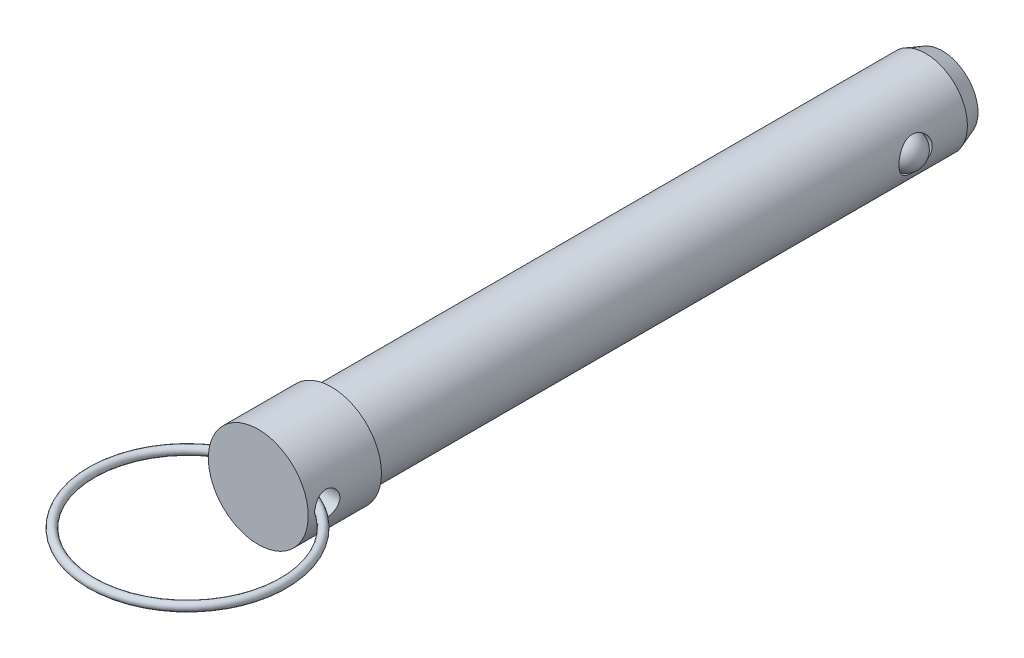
ISO-10303-21;
HEADER;
FILE_DESCRIPTION(('STEP AP214'),'2;1');
FILE_NAME('part.step','',(''),(''),'','','');
FILE_SCHEMA(('AUTOMOTIVE_DESIGN { 1 0 10303 214 1 1 1 1 }'));
ENDSEC;
DATA;
#1=APPLICATION_CONTEXT('core data for automotive mechanical design processes');
#2=APPLICATION_PROTOCOL_DEFINITION('international standard','automotive_design',2000,#1);
#3=PRODUCT_CONTEXT('',#1,'mechanical');
#4=PRODUCT('Part','Part','',(#3));
#5=PRODUCT_RELATED_PRODUCT_CATEGORY('part','',(#4));
#6=PRODUCT_DEFINITION_FORMATION('','',#4);
#7=PRODUCT_DEFINITION_CONTEXT('part definition',#1,'design');
#8=PRODUCT_DEFINITION('design','',#6,#7);
#9=PRODUCT_DEFINITION_SHAPE('','',#8);
#10=(LENGTH_UNIT() NAMED_UNIT(*) SI_UNIT(.MILLI.,.METRE.));
#11=(NAMED_UNIT(*) PLANE_ANGLE_UNIT() SI_UNIT($,.RADIAN.));
#12=(NAMED_UNIT(*) SI_UNIT($,.STERADIAN.) SOLID_ANGLE_UNIT());
#13=UNCERTAINTY_MEASURE_WITH_UNIT(LENGTH_MEASURE(1.E-05),#10,'distance_accuracy_value','');
#14=(GEOMETRIC_REPRESENTATION_CONTEXT(3) GLOBAL_UNCERTAINTY_ASSIGNED_CONTEXT((#13)) GLOBAL_UNIT_ASSIGNED_CONTEXT((#10,
#11,#12)) REPRESENTATION_CONTEXT('',''));
#15=CARTESIAN_POINT('',(0.,0.,0.));
#16=DIRECTION('',(0.,0.,1.));
#17=DIRECTION('',(1.,0.,0.));
#18=AXIS2_PLACEMENT_3D('',#15,#16,#17);
#19=CARTESIAN_POINT('',(12.7,0.,10.3124));
#20=DIRECTION('',(-1.,0.,0.));
#21=DIRECTION('',(0.,0.,-1.));
#22=AXIS2_PLACEMENT_3D('',#19,#20,#21);
#23=CYLINDRICAL_SURFACE('',#22,2.38125);
#24=CARTESIAN_POINT('',(-9.52520000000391,0.403786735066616,12.6591653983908));
#25=CARTESIAN_POINT('',(-9.50280720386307,0.376324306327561,12.6639011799));
#26=CARTESIAN_POINT('',(-9.48237104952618,0.347125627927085,12.6684187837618));
#27=CARTESIAN_POINT('',(-9.44617017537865,0.285700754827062,12.6766499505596));
#28=CARTESIAN_POINT('',(-9.43042598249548,0.253462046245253,12.680359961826));
#29=CARTESIAN_POINT('',(-9.40451586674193,0.186496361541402,12.6865748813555));
#30=CARTESIAN_POINT('',(-9.39437574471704,0.151758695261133,12.6890742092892));
#31=CARTESIAN_POINT('',(-9.38043438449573,0.0810334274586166,12.6925329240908));
#32=CARTESIAN_POINT('',(-9.37661767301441,0.0450490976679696,12.693496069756));
#33=CARTESIAN_POINT('',(-9.37556693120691,-0.0245285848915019,12.6937603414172));
#34=CARTESIAN_POINT('',(-9.37789685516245,-0.0581155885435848,12.6931715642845));
#35=CARTESIAN_POINT('',(-9.38809271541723,-0.124408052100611,12.690629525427));
#36=CARTESIAN_POINT('',(-9.39596338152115,-0.157112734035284,12.6886750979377));
#37=CARTESIAN_POINT('',(-9.416669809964,-0.220319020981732,12.6836454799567));
#38=CARTESIAN_POINT('',(-9.42943899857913,-0.250843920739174,12.6805853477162));
#39=CARTESIAN_POINT('',(-9.45932823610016,-0.309529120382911,12.6736319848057));
#40=CARTESIAN_POINT('',(-9.47644453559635,-0.337691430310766,12.6697394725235));
#41=CARTESIAN_POINT('',(-9.50487916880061,-0.377944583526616,12.6635052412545));
#42=CARTESIAN_POINT('',(-9.51483286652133,-0.391047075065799,12.6613580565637));
#43=CARTESIAN_POINT('',(-9.5252,-0.403786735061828,12.6591653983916));
#44=B_SPLINE_CURVE_WITH_KNOTS('',3,(#24,#25,#26,#27,#28,#29,#30,#31,#32,#33,#34,#35,#36,#37,#38,
#39,#40,#41,#42,#43),.UNSPECIFIED.,.F.,.F.,(4,2,2,2,2,2,2,2,2,4),(0.,0.107278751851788,
0.215020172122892,0.323253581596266,0.431221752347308,0.531739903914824,0.632343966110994,
0.731626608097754,0.830823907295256,0.880558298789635),.UNSPECIFIED.);
#45=CARTESIAN_POINT('',(-9.5168741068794,0.393360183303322,12.6609355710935));
#46=VERTEX_POINT('',#45);
#47=CARTESIAN_POINT('',(-9.5168741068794,-0.393360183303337,12.6609355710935));
#48=VERTEX_POINT('',#47);
#49=EDGE_CURVE('E40',#46,#48,#44,.T.);
#50=ORIENTED_EDGE('',*,*,#49,.F.);
#51=CARTESIAN_POINT('',(-9.525,0.,12.69365));
#52=CARTESIAN_POINT('',(-9.52499609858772,-0.131413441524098,12.6936432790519));
#53=CARTESIAN_POINT('',(-9.52225017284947,-0.262981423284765,12.6827233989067));
#54=CARTESIAN_POINT('',(-9.51155070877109,-0.522463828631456,12.6393611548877));
#55=CARTESIAN_POINT('',(-9.50358736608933,-0.650370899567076,12.6068782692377));
#56=CARTESIAN_POINT('',(-9.48333647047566,-0.898571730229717,12.5214962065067));
#57=CARTESIAN_POINT('',(-9.47105633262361,-1.01887813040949,12.4686320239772));
#58=CARTESIAN_POINT('',(-9.44348288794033,-1.24887539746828,12.3440911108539));
#59=CARTESIAN_POINT('',(-9.42819036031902,-1.35856899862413,12.2724192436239));
#60=CARTESIAN_POINT('',(-9.39589563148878,-1.56654481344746,12.1107209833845));
#61=CARTESIAN_POINT('',(-9.37886690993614,-1.66457667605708,12.0203778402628));
#62=CARTESIAN_POINT('',(-9.34519463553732,-1.84427203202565,11.8245754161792));
#63=CARTESIAN_POINT('',(-9.32855114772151,-1.92593277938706,11.7191136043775));
#64=CARTESIAN_POINT('',(-9.29726950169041,-2.07172989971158,11.4941421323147));
#65=CARTESIAN_POINT('',(-9.28266474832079,-2.135588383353,11.3744473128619));
#66=CARTESIAN_POINT('',(-9.25749814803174,-2.24218043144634,11.1255983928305));
#67=CARTESIAN_POINT('',(-9.24693562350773,-2.28491753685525,10.9964458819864));
#68=CARTESIAN_POINT('',(-9.23132007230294,-2.34720578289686,10.735082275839));
#69=CARTESIAN_POINT('',(-9.2261609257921,-2.36720420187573,10.6029842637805));
#70=CARTESIAN_POINT('',(-9.22161862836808,-2.38484057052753,10.337215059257));
#71=CARTESIAN_POINT('',(-9.22223454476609,-2.38248213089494,10.203544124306));
#72=CARTESIAN_POINT('',(-9.22907737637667,-2.35582865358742,9.94185283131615));
#73=CARTESIAN_POINT('',(-9.23516790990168,-2.33206678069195,9.81377404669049));
#74=CARTESIAN_POINT('',(-9.2520564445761,-2.26413118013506,9.56348014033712));
#75=CARTESIAN_POINT('',(-9.26285481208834,-2.21995586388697,9.44126547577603));
#76=CARTESIAN_POINT('',(-9.2880678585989,-2.11199151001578,9.2047369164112));
#77=CARTESIAN_POINT('',(-9.30251804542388,-2.0480084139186,9.09051554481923));
#78=CARTESIAN_POINT('',(-9.33338526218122,-1.90238497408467,8.87424717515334));
#79=CARTESIAN_POINT('',(-9.34980250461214,-1.82074272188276,8.77220149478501));
#80=CARTESIAN_POINT('',(-9.38332621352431,-1.63937203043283,8.58013373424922));
#81=CARTESIAN_POINT('',(-9.40043902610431,-1.53919654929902,8.49053442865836));
#82=CARTESIAN_POINT('',(-9.43301349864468,-1.32499024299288,8.32928984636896));
#83=CARTESIAN_POINT('',(-9.44847444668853,-1.21095348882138,8.25765229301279));
#84=CARTESIAN_POINT('',(-9.47608221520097,-0.971626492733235,8.1342112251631));
#85=CARTESIAN_POINT('',(-9.48821487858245,-0.846291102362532,8.08249206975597));
#86=CARTESIAN_POINT('',(-9.50767711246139,-0.588486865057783,8.00107256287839));
#87=CARTESIAN_POINT('',(-9.5150166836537,-0.456033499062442,7.97132634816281));
#88=CARTESIAN_POINT('',(-9.52135931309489,-0.268741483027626,7.94574782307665));
#89=CARTESIAN_POINT('',(-9.52272120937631,-0.215156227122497,7.94027893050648));
#90=CARTESIAN_POINT('',(-9.52454235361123,-0.107722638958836,7.93297863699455));
#91=CARTESIAN_POINT('',(-9.52500159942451,-0.0538743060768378,7.93114724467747));
#92=CARTESIAN_POINT('',(-9.52499609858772,0.131413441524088,7.93115672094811));
#93=CARTESIAN_POINT('',(-9.52225017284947,0.262981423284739,7.94207660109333));
#94=CARTESIAN_POINT('',(-9.51155070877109,0.522463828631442,7.98543884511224));
#95=CARTESIAN_POINT('',(-9.50358736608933,0.650370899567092,8.01792173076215));
#96=CARTESIAN_POINT('',(-9.48333647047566,0.898571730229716,8.10330379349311));
#97=CARTESIAN_POINT('',(-9.47105633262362,1.01887813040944,8.15616797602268));
#98=CARTESIAN_POINT('',(-9.44348288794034,1.24887539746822,8.28070888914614));
#99=CARTESIAN_POINT('',(-9.42819036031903,1.35856899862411,8.35238075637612));
#100=CARTESIAN_POINT('',(-9.39589563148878,1.56654481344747,8.51407901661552));
#101=CARTESIAN_POINT('',(-9.37886690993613,1.66457667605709,8.60442215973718));
#102=CARTESIAN_POINT('',(-9.34519463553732,1.84427203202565,8.80022458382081));
#103=CARTESIAN_POINT('',(-9.3285511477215,1.92593277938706,8.90568639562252));
#104=CARTESIAN_POINT('',(-9.29726950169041,2.07172989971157,9.1306578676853));
#105=CARTESIAN_POINT('',(-9.28266474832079,2.135588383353,9.2503526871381));
#106=CARTESIAN_POINT('',(-9.25749814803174,2.24218043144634,9.49920160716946));
#107=CARTESIAN_POINT('',(-9.24693562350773,2.28491753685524,9.62835411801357));
#108=CARTESIAN_POINT('',(-9.23132007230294,2.34720578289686,9.88971772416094));
#109=CARTESIAN_POINT('',(-9.2261609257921,2.36720420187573,10.0218157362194));
#110=CARTESIAN_POINT('',(-9.22161862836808,2.38484057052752,10.2875849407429));
#111=CARTESIAN_POINT('',(-9.22223454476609,2.38248213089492,10.4212558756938));
#112=CARTESIAN_POINT('',(-9.22907737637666,2.35582865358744,10.6829471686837));
#113=CARTESIAN_POINT('',(-9.23516790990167,2.33206678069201,10.8110259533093));
#114=CARTESIAN_POINT('',(-9.25205644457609,2.26413118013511,11.0613198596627));
#115=CARTESIAN_POINT('',(-9.26285481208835,2.21995586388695,11.1835345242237));
#116=CARTESIAN_POINT('',(-9.28806785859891,2.1119915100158,11.4200630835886));
#117=CARTESIAN_POINT('',(-9.30251804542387,2.0480084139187,11.5342844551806));
#118=CARTESIAN_POINT('',(-9.3333852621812,1.90238497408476,11.7505528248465));
#119=CARTESIAN_POINT('',(-9.34980250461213,1.82074272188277,11.8525985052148));
#120=CARTESIAN_POINT('',(-9.38332621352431,1.63937203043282,12.0446662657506));
#121=CARTESIAN_POINT('',(-9.40043902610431,1.53919654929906,12.1342655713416));
#122=CARTESIAN_POINT('',(-9.43301349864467,1.32499024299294,12.295510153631));
#123=CARTESIAN_POINT('',(-9.44847444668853,1.21095348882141,12.3671477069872));
#124=CARTESIAN_POINT('',(-9.47608221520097,0.971626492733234,12.4905887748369));
#125=CARTESIAN_POINT('',(-9.48821487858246,0.84629110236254,12.542307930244));
#126=CARTESIAN_POINT('',(-9.50767711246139,0.588486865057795,12.6237274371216));
#127=CARTESIAN_POINT('',(-9.5150166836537,0.456033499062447,12.6534736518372));
#128=CARTESIAN_POINT('',(-9.52135931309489,0.268741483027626,12.6790521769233));
#129=CARTESIAN_POINT('',(-9.52272120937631,0.215156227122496,12.6845210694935));
#130=CARTESIAN_POINT('',(-9.52454235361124,0.107722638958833,12.6918213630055));
#131=CARTESIAN_POINT('',(-9.52500159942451,0.0538743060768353,12.6936527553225));
#132=CARTESIAN_POINT('',(-9.525,0.,12.69365));
#133=B_SPLINE_CURVE_WITH_KNOTS('',3,(#51,#52,#53,#54,#55,#56,#57,#58,#59,#60,#61,#62,#63,#64,
#65,#66,#67,#68,#69,#70,#71,#72,#73,#74,#75,#76,#77,#78,#79,#80,#81,#82,#83,#84,#85,#86,#87,#88,
#89,#90,#91,#92,#93,#94,#95,#96,#97,#98,#99,#100,#101,#102,#103,#104,#105,#106,#107,#108,#109,
#110,#111,#112,#113,#114,#115,#116,#117,#118,#119,#120,#121,#122,#123,#124,#125,#126,#127,#128,
#129,#130,#131,#132),.UNSPECIFIED.,.T.,.F.,(4,2,2,2,2,2,2,2,2,2,2,2,2,2,2,2,2,2,2,2,2,2,2,2,2,2,
2,2,2,2,2,2,2,2,2,2,2,2,2,2,4),(0.,0.394033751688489,0.788810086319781,1.18291158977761,
1.57691128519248,1.97824318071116,2.37964233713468,2.78699511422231,3.19427957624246,
3.59340594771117,3.99246786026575,4.38185586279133,4.77127417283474,5.16463530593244,
5.55803897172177,5.96259318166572,6.36732104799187,6.77374466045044,7.1793175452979,
7.34085539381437,7.50239362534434,7.89642737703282,8.29120371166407,8.68530521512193,
9.07930491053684,9.48063680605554,9.88203596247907,10.2893887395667,10.6966732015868,
11.0957995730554,11.4948614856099,11.8842494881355,12.2736677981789,12.6670289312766,
13.060432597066,13.46498680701,13.8697146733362,14.2761382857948,14.6817111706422,
14.8432490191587,15.0047872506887),.UNSPECIFIED.);
#134=EDGE_CURVE('E66',#48,#46,#133,.T.);
#135=ORIENTED_EDGE('',*,*,#134,.F.);
#136=EDGE_LOOP('',(#50,#135));
#137=FACE_BOUND('',#136,.T.);
#138=CARTESIAN_POINT('',(9.5252,-0.403786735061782,12.6591653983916));
#139=CARTESIAN_POINT('',(9.50280720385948,-0.376324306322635,12.6639011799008));
#140=CARTESIAN_POINT('',(9.48237104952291,-0.34712562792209,12.6684187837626));
#141=CARTESIAN_POINT('',(9.44617017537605,-0.285700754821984,12.6766499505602));
#142=CARTESIAN_POINT('',(9.43042598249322,-0.253462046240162,12.6803599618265));
#143=CARTESIAN_POINT('',(9.40451586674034,-0.186496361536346,12.6865748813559));
#144=CARTESIAN_POINT('',(9.39437574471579,-0.151758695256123,12.6890742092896));
#145=CARTESIAN_POINT('',(9.38043438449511,-0.0810334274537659,12.692532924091));
#146=CARTESIAN_POINT('',(9.37661767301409,-0.0450490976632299,12.693496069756));
#147=CARTESIAN_POINT('',(9.37556693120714,0.024528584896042,12.6937603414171));
#148=CARTESIAN_POINT('',(9.37789685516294,0.0581155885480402,12.6931715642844));
#149=CARTESIAN_POINT('',(9.38809271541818,0.124408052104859,12.6906295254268));
#150=CARTESIAN_POINT('',(9.39596338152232,0.157112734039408,12.6886750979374));
#151=CARTESIAN_POINT('',(9.41666980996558,0.220319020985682,12.6836454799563));
#152=CARTESIAN_POINT('',(9.42943899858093,0.250843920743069,12.6805853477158));
#153=CARTESIAN_POINT('',(9.45932823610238,0.30952912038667,12.6736319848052));
#154=CARTESIAN_POINT('',(9.47644453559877,0.337691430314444,12.6697394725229));
#155=CARTESIAN_POINT('',(9.50487916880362,0.377944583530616,12.6635052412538));
#156=CARTESIAN_POINT('',(9.51483286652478,0.391047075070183,12.661358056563));
#157=CARTESIAN_POINT('',(9.52520000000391,0.403786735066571,12.6591653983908));
#158=B_SPLINE_CURVE_WITH_KNOTS('',3,(#138,#139,#140,#141,#142,#143,#144,#145,#146,#147,#148,
#149,#150,#151,#152,#153,#154,#155,#156,#157),.UNSPECIFIED.,.F.,.F.,(4,2,2,2,2,2,2,2,2,4),(0.,
0.107278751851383,0.215020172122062,0.323253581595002,0.431221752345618,0.531739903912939,
0.632343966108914,0.731626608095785,0.830823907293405,0.880558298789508),.UNSPECIFIED.);
#159=CARTESIAN_POINT('',(9.5168741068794,-0.393360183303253,12.6609355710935));
#160=VERTEX_POINT('',#159);
#161=CARTESIAN_POINT('',(9.51687410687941,0.393360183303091,12.6609355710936));
#162=VERTEX_POINT('',#161);
#163=EDGE_CURVE('E33',#160,#162,#158,.T.);
#164=ORIENTED_EDGE('',*,*,#163,.F.);
#165=CARTESIAN_POINT('',(9.525,0.,7.93115));
#166=CARTESIAN_POINT('',(9.52499609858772,-0.131413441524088,7.93115672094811));
#167=CARTESIAN_POINT('',(9.52225017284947,-0.262981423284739,7.94207660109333));
#168=CARTESIAN_POINT('',(9.51155070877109,-0.522463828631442,7.98543884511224));
#169=CARTESIAN_POINT('',(9.50358736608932,-0.65037089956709,8.01792173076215));
#170=CARTESIAN_POINT('',(9.48333647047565,-0.898571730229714,8.10330379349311));
#171=CARTESIAN_POINT('',(9.47105633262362,-1.01887813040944,8.15616797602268));
#172=CARTESIAN_POINT('',(9.44348288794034,-1.24887539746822,8.28070888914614));
#173=CARTESIAN_POINT('',(9.42819036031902,-1.35856899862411,8.35238075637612));
#174=CARTESIAN_POINT('',(9.39589563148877,-1.56654481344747,8.51407901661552));
#175=CARTESIAN_POINT('',(9.37886690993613,-1.66457667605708,8.60442215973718));
#176=CARTESIAN_POINT('',(9.34519463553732,-1.84427203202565,8.80022458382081));
#177=CARTESIAN_POINT('',(9.32855114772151,-1.92593277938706,8.90568639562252));
#178=CARTESIAN_POINT('',(9.29726950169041,-2.07172989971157,9.1306578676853));
#179=CARTESIAN_POINT('',(9.28266474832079,-2.135588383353,9.2503526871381));
#180=CARTESIAN_POINT('',(9.25749814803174,-2.24218043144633,9.49920160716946));
#181=CARTESIAN_POINT('',(9.24693562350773,-2.28491753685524,9.62835411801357));
#182=CARTESIAN_POINT('',(9.23132007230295,-2.34720578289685,9.88971772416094));
#183=CARTESIAN_POINT('',(9.22616092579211,-2.36720420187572,10.0218157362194));
#184=CARTESIAN_POINT('',(9.22161862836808,-2.38484057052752,10.2875849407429));
#185=CARTESIAN_POINT('',(9.22223454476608,-2.38248213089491,10.4212558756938));
#186=CARTESIAN_POINT('',(9.22907737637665,-2.35582865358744,10.6829471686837));
#187=CARTESIAN_POINT('',(9.23516790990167,-2.332066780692,10.8110259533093));
#188=CARTESIAN_POINT('',(9.25205644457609,-2.26413118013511,11.0613198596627));
#189=CARTESIAN_POINT('',(9.26285481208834,-2.21995586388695,11.1835345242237));
#190=CARTESIAN_POINT('',(9.28806785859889,-2.11199151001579,11.4200630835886));
#191=CARTESIAN_POINT('',(9.30251804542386,-2.0480084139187,11.5342844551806));
#192=CARTESIAN_POINT('',(9.3333852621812,-1.90238497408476,11.7505528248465));
#193=CARTESIAN_POINT('',(9.34980250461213,-1.82074272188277,11.8525985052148));
#194=CARTESIAN_POINT('',(9.38332621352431,-1.63937203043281,12.0446662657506));
#195=CARTESIAN_POINT('',(9.40043902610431,-1.53919654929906,12.1342655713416));
#196=CARTESIAN_POINT('',(9.43301349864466,-1.32499024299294,12.295510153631));
#197=CARTESIAN_POINT('',(9.44847444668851,-1.2109534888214,12.3671477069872));
#198=CARTESIAN_POINT('',(9.47608221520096,-0.97162649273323,12.4905887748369));
#199=CARTESIAN_POINT('',(9.48821487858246,-0.846291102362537,12.542307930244));
#200=CARTESIAN_POINT('',(9.50767711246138,-0.588486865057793,12.6237274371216));
#201=CARTESIAN_POINT('',(9.51501668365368,-0.456033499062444,12.6534736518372));
#202=CARTESIAN_POINT('',(9.52135931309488,-0.268741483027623,12.6790521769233));
#203=CARTESIAN_POINT('',(9.52272120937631,-0.215156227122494,12.6845210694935));
#204=CARTESIAN_POINT('',(9.52454235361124,-0.107722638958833,12.6918213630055));
#205=CARTESIAN_POINT('',(9.52500159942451,-0.0538743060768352,12.6936527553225));
#206=CARTESIAN_POINT('',(9.52499609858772,0.131413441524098,12.6936432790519));
#207=CARTESIAN_POINT('',(9.52225017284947,0.262981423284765,12.6827233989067));
#208=CARTESIAN_POINT('',(9.51155070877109,0.522463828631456,12.6393611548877));
#209=CARTESIAN_POINT('',(9.50358736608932,0.650370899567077,12.6068782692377));
#210=CARTESIAN_POINT('',(9.48333647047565,0.898571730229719,12.5214962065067));
#211=CARTESIAN_POINT('',(9.47105633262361,1.01887813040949,12.4686320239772));
#212=CARTESIAN_POINT('',(9.44348288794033,1.24887539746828,12.3440911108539));
#213=CARTESIAN_POINT('',(9.42819036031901,1.35856899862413,12.2724192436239));
#214=CARTESIAN_POINT('',(9.39589563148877,1.56654481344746,12.1107209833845));
#215=CARTESIAN_POINT('',(9.37886690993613,1.66457667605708,12.0203778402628));
#216=CARTESIAN_POINT('',(9.34519463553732,1.84427203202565,11.8245754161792));
#217=CARTESIAN_POINT('',(9.3285511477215,1.92593277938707,11.7191136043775));
#218=CARTESIAN_POINT('',(9.29726950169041,2.07172989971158,11.4941421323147));
#219=CARTESIAN_POINT('',(9.2826647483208,2.13558838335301,11.3744473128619));
#220=CARTESIAN_POINT('',(9.25749814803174,2.24218043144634,11.1255983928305));
#221=CARTESIAN_POINT('',(9.24693562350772,2.28491753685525,10.9964458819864));
#222=CARTESIAN_POINT('',(9.23132007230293,2.34720578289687,10.735082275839));
#223=CARTESIAN_POINT('',(9.2261609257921,2.36720420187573,10.6029842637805));
#224=CARTESIAN_POINT('',(9.22161862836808,2.38484057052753,10.337215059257));
#225=CARTESIAN_POINT('',(9.22223454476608,2.38248213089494,10.203544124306));
#226=CARTESIAN_POINT('',(9.22907737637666,2.35582865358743,9.94185283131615));
#227=CARTESIAN_POINT('',(9.23516790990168,2.33206678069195,9.81377404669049));
#228=CARTESIAN_POINT('',(9.25205644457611,2.26413118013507,9.56348014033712));
#229=CARTESIAN_POINT('',(9.26285481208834,2.21995586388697,9.44126547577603));
#230=CARTESIAN_POINT('',(9.28806785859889,2.11199151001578,9.2047369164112));
#231=CARTESIAN_POINT('',(9.30251804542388,2.0480084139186,9.09051554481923));
#232=CARTESIAN_POINT('',(9.33338526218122,1.90238497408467,8.87424717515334));
#233=CARTESIAN_POINT('',(9.34980250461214,1.82074272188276,8.77220149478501));
#234=CARTESIAN_POINT('',(9.38332621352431,1.63937203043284,8.58013373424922));
#235=CARTESIAN_POINT('',(9.40043902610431,1.53919654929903,8.49053442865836));
#236=CARTESIAN_POINT('',(9.43301349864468,1.32499024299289,8.32928984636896));
#237=CARTESIAN_POINT('',(9.44847444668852,1.21095348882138,8.25765229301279));
#238=CARTESIAN_POINT('',(9.47608221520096,0.971626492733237,8.1342112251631));
#239=CARTESIAN_POINT('',(9.48821487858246,0.846291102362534,8.08249206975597));
#240=CARTESIAN_POINT('',(9.50767711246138,0.588486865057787,8.00107256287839));
#241=CARTESIAN_POINT('',(9.51501668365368,0.456033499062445,7.97132634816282));
#242=CARTESIAN_POINT('',(9.52135931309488,0.268741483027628,7.94574782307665));
#243=CARTESIAN_POINT('',(9.52272120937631,0.2151562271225,7.94027893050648));
#244=CARTESIAN_POINT('',(9.52454235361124,0.107722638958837,7.93297863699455));
#245=CARTESIAN_POINT('',(9.52500159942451,0.0538743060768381,7.93114724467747));
#246=CARTESIAN_POINT('',(9.525,0.,7.93115));
#247=B_SPLINE_CURVE_WITH_KNOTS('',3,(#165,#166,#167,#168,#169,#170,#171,#172,#173,#174,#175,
#176,#177,#178,#179,#180,#181,#182,#183,#184,#185,#186,#187,#188,#189,#190,#191,#192,#193,#194,
#195,#196,#197,#198,#199,#200,#201,#202,#203,#204,#205,#206,#207,#208,#209,#210,#211,#212,#213,
#214,#215,#216,#217,#218,#219,#220,#221,#222,#223,#224,#225,#226,#227,#228,#229,#230,#231,#232,
#233,#234,#235,#236,#237,#238,#239,#240,#241,#242,#243,#244,#245,#246),.UNSPECIFIED.,.T.,.F.,(4,
2,2,2,2,2,2,2,2,2,2,2,2,2,2,2,2,2,2,2,2,2,2,2,2,2,2,2,2,2,2,2,2,2,2,2,2,2,2,2,4),(0.,
0.394033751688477,0.788810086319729,1.18291158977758,1.57691128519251,1.9782431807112,
2.37964233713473,2.78699511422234,3.19427957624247,3.5934059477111,3.99246786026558,
4.38185586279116,4.77127417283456,5.16463530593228,5.55803897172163,5.96259318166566,
6.36732104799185,6.77374466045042,7.17931754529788,7.34085539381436,7.50239362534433,
7.89642737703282,8.29120371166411,8.68530521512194,9.07930491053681,9.48063680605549,
9.88203596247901,10.2893887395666,10.6966732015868,11.0957995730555,11.4948614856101,
11.8842494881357,12.2736677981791,12.6670289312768,13.0604325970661,13.4649868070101,
13.8697146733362,14.2761382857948,14.6817111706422,14.8432490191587,15.0047872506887),.UNSPECIFIED.);
#248=EDGE_CURVE('E62',#162,#160,#247,.T.);
#249=ORIENTED_EDGE('',*,*,#248,.F.);
#250=EDGE_LOOP('',(#164,#249));
#251=FACE_BOUND('',#250,.T.);
#252=ADVANCED_FACE('F14',(#137,#251),#23,.F.);
#253=CARTESIAN_POINT('',(0.,0.,-66.5099));
#254=DIRECTION('',(0.,0.,-1.));
#255=DIRECTION('',(1.,0.,0.));
#256=AXIS2_PLACEMENT_3D('',#253,#254,#255);
#257=CYLINDRICAL_SURFACE('',#256,9.525);
#258=ORIENTED_EDGE('',*,*,#248,.T.);
#259=CARTESIAN_POINT('',(9.52357857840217,-0.164593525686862,10.9334349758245));
#260=CARTESIAN_POINT('',(9.52285261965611,-0.206594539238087,10.9432079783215));
#261=CARTESIAN_POINT('',(9.52186052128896,-0.247732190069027,10.9567086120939));
#262=CARTESIAN_POINT('',(9.5194658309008,-0.327064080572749,10.9905825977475));
#263=CARTESIAN_POINT('',(9.51806301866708,-0.365256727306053,11.0109596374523));
#264=CARTESIAN_POINT('',(9.51501164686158,-0.437593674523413,11.0576904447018));
#265=CARTESIAN_POINT('',(9.51336385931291,-0.471750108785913,11.0840255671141));
#266=CARTESIAN_POINT('',(9.50999164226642,-0.535446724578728,11.1417575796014));
#267=CARTESIAN_POINT('',(9.50826720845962,-0.564986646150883,11.173154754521));
#268=CARTESIAN_POINT('',(9.50480568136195,-0.620577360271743,11.2419737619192));
#269=CARTESIAN_POINT('',(9.50307368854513,-0.646325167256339,11.2796398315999));
#270=CARTESIAN_POINT('',(9.49986523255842,-0.691887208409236,11.3584043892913));
#271=CARTESIAN_POINT('',(9.49838887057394,-0.711699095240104,11.3995042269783));
#272=CARTESIAN_POINT('',(9.4956619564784,-0.747251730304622,11.4889631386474));
#273=CARTESIAN_POINT('',(9.49445690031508,-0.76226224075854,11.5376134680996));
#274=CARTESIAN_POINT('',(9.49261137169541,-0.784908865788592,11.6366040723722));
#275=CARTESIAN_POINT('',(9.49197116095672,-0.792541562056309,11.6869451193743));
#276=CARTESIAN_POINT('',(9.49125223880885,-0.80111156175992,11.7944077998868));
#277=CARTESIAN_POINT('',(9.49125185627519,-0.801114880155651,11.8516051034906));
#278=CARTESIAN_POINT('',(9.49198716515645,-0.792351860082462,11.9653442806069));
#279=CARTESIAN_POINT('',(9.49272343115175,-0.783578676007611,12.0218856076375));
#280=CARTESIAN_POINT('',(9.49492985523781,-0.756396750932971,12.1376462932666));
#281=CARTESIAN_POINT('',(9.49645656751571,-0.737239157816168,12.1966905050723));
#282=CARTESIAN_POINT('',(9.50007212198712,-0.68908400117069,12.3106190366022));
#283=CARTESIAN_POINT('',(9.50216065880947,-0.660091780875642,12.3655055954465));
#284=CARTESIAN_POINT('',(9.5061727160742,-0.599197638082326,12.4586498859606));
#285=CARTESIAN_POINT('',(9.50804625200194,-0.569025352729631,12.4980422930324));
#286=CARTESIAN_POINT('',(9.51178521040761,-0.502660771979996,12.5713795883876));
#287=CARTESIAN_POINT('',(9.51365064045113,-0.466476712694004,12.6053318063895));
#288=CARTESIAN_POINT('',(9.51685091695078,-0.395240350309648,12.6608918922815));
#289=CARTESIAN_POINT('',(9.51822183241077,-0.361064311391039,12.6836185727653));
#290=CARTESIAN_POINT('',(9.52066971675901,-0.289403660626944,12.7231300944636));
#291=CARTESIAN_POINT('',(9.52174683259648,-0.251920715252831,12.7399179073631));
#292=CARTESIAN_POINT('',(9.52348499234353,-0.174277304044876,12.7666136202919));
#293=CARTESIAN_POINT('',(9.52414339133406,-0.134101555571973,12.7764778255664));
#294=CARTESIAN_POINT('',(9.52494165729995,-0.0526036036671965,12.7884029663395));
#295=CARTESIAN_POINT('',(9.52508181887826,-0.011282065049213,12.7904683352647));
#296=CARTESIAN_POINT('',(9.52483855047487,0.0665311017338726,12.7868527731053));
#297=CARTESIAN_POINT('',(9.52450990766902,0.103063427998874,12.7819824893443));
#298=CARTESIAN_POINT('',(9.52346362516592,0.174793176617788,12.7662317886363));
#299=CARTESIAN_POINT('',(9.52274596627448,0.209990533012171,12.7553510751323));
#300=CARTESIAN_POINT('',(9.52098965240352,0.278511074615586,12.7280748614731));
#301=CARTESIAN_POINT('',(9.51994819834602,0.311814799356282,12.711631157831));
#302=CARTESIAN_POINT('',(9.51764425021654,0.375625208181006,12.6740346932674));
#303=CARTESIAN_POINT('',(9.51638167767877,0.406130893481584,12.652880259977));
#304=CARTESIAN_POINT('',(9.51355787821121,0.467892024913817,12.6035266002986));
#305=CARTESIAN_POINT('',(9.51197933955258,0.498693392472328,12.5747619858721));
#306=CARTESIAN_POINT('',(9.50880383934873,0.555966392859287,12.5132165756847));
#307=CARTESIAN_POINT('',(9.5072068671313,0.582435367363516,12.4804333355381));
#308=CARTESIAN_POINT('',(9.50381893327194,0.635521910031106,12.4052048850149));
#309=CARTESIAN_POINT('',(9.5020486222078,0.661215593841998,12.3621064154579));
#310=CARTESIAN_POINT('',(9.49881088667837,0.706204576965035,12.2726816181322));
#311=CARTESIAN_POINT('',(9.49734366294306,0.725495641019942,12.226353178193));
#312=CARTESIAN_POINT('',(9.4946305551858,0.760244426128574,12.1236208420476));
#313=CARTESIAN_POINT('',(9.49346151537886,0.774538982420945,12.0668185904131));
#314=CARTESIAN_POINT('',(9.49184552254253,0.794096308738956,11.9516498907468));
#315=CARTESIAN_POINT('',(9.49139897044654,0.799354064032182,11.8932825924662));
#316=CARTESIAN_POINT('',(9.49129668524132,0.800572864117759,11.7725602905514));
#317=CARTESIAN_POINT('',(9.49169513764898,0.795896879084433,11.7101965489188));
#318=CARTESIAN_POINT('',(9.49338041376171,0.775537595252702,11.5872717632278));
#319=CARTESIAN_POINT('',(9.49466708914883,0.759856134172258,11.5267104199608));
#320=CARTESIAN_POINT('',(9.49788554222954,0.718469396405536,11.4130225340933));
#321=CARTESIAN_POINT('',(9.49977609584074,0.693390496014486,11.3596687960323));
#322=CARTESIAN_POINT('',(9.50396663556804,0.633358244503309,11.2588392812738));
#323=CARTESIAN_POINT('',(9.50626619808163,0.598415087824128,11.2113575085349));
#324=CARTESIAN_POINT('',(9.51060969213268,0.524509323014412,11.1303420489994));
#325=CARTESIAN_POINT('',(9.51264813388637,0.486654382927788,11.0957982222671));
#326=CARTESIAN_POINT('',(9.51647425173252,0.40497404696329,11.0346592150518));
#327=CARTESIAN_POINT('',(9.51826215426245,0.361154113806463,11.0080568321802));
#328=CARTESIAN_POINT('',(9.52112145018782,0.27477388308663,10.9669572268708));
#329=CARTESIAN_POINT('',(9.52225427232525,0.232733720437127,10.9513665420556));
#330=CARTESIAN_POINT('',(9.5239701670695,0.14652162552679,10.9280871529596));
#331=CARTESIAN_POINT('',(9.52455371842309,0.102351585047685,10.9203915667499));
#332=CARTESIAN_POINT('',(9.52505054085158,0.0206478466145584,10.9138368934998));
#333=CARTESIAN_POINT('',(9.52505775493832,-0.0167909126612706,10.9137393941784));
#334=CARTESIAN_POINT('',(9.52463596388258,-0.0912332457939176,10.9193087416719));
#335=CARTESIAN_POINT('',(9.52420697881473,-0.128236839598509,10.9249753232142));
#336=CARTESIAN_POINT('',(9.52357857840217,-0.164593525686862,10.9334349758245));
#337=B_SPLINE_CURVE_WITH_KNOTS('',3,(#259,#260,#261,#262,#263,#264,#265,#266,#267,#268,#269,
#270,#271,#272,#273,#274,#275,#276,#277,#278,#279,#280,#281,#282,#283,#284,#285,#286,#287,#288,
#289,#290,#291,#292,#293,#294,#295,#296,#297,#298,#299,#300,#301,#302,#303,#304,#305,#306,#307,
#308,#309,#310,#311,#312,#313,#314,#315,#316,#317,#318,#319,#320,#321,#322,#323,#324,#325,#326,
#327,#328,#329,#330,#331,#332,#333,#334,#335,#336),.UNSPECIFIED.,.T.,.F.,(4,2,2,2,2,2,2,2,2,2,2,
2,2,2,2,2,2,2,2,2,2,2,2,2,2,2,2,2,2,2,2,2,2,2,2,2,2,2,4),(0.,0.12924156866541,0.258552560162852,
0.387464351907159,0.516383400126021,0.652802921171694,0.789276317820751,0.941444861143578,
1.09368387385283,1.26455903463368,1.43556758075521,1.62096953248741,1.80627091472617,
1.95466545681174,2.10285835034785,2.22555608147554,2.3481923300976,2.47159573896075,
2.59492898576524,2.70497370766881,2.81502385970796,2.92605312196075,3.03712186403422,
3.16317494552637,3.28930508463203,3.4393564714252,3.58950691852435,3.76451254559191,
3.93961525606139,4.12628428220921,4.31292214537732,4.48885737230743,4.66461143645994,
4.8175899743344,4.97042934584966,5.10427604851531,5.23800598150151,5.34988450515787,
5.46175788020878),.UNSPECIFIED.);
#338=EDGE_CURVE('E27',#160,#162,#337,.T.);
#339=ORIENTED_EDGE('',*,*,#338,.T.);
#340=EDGE_LOOP('',(#258,#339));
#341=FACE_BOUND('',#340,.T.);
#342=CARTESIAN_POINT('',(0.,0.,13.97));
#343=DIRECTION('',(0.,0.,-1.));
#344=DIRECTION('',(1.,0.,0.));
#345=AXIS2_PLACEMENT_3D('',#342,#343,#344);
#346=CIRCLE('',#345,9.525);
#347=CARTESIAN_POINT('',(9.525,0.,13.97));
#348=VERTEX_POINT('',#347);
#349=EDGE_CURVE('E71',#348,#348,#346,.T.);
#350=ORIENTED_EDGE('',*,*,#349,.T.);
#351=EDGE_LOOP('',(#350));
#352=FACE_BOUND('',#351,.T.);
#353=CARTESIAN_POINT('',(0.,0.,0.));
#354=DIRECTION('',(0.,0.,-1.));
#355=DIRECTION('',(1.,0.,0.));
#356=AXIS2_PLACEMENT_3D('',#353,#354,#355);
#357=CIRCLE('',#356,9.525);
#358=CARTESIAN_POINT('',(9.525,0.,0.));
#359=VERTEX_POINT('',#358);
#360=EDGE_CURVE('E279',#359,#359,#357,.T.);
#361=ORIENTED_EDGE('',*,*,#360,.F.);
#362=EDGE_LOOP('',(#361));
#363=FACE_BOUND('',#362,.T.);
#364=ORIENTED_EDGE('',*,*,#134,.T.);
#365=CARTESIAN_POINT('',(-9.52357857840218,-0.164593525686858,10.9334349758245));
#366=CARTESIAN_POINT('',(-9.5242661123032,-0.12480679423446,10.9241783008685));
#367=CARTESIAN_POINT('',(-9.52471508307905,-0.0842328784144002,10.9182635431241));
#368=CARTESIAN_POINT('',(-9.52508674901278,-0.00265875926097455,10.9133589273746));
#369=CARTESIAN_POINT('',(-9.52500935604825,0.0383415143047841,10.9143702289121));
#370=CARTESIAN_POINT('',(-9.52433621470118,0.119561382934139,10.9232770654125));
#371=CARTESIAN_POINT('',(-9.52374069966,0.159781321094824,10.9311695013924));
#372=CARTESIAN_POINT('',(-9.52209876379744,0.23833817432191,10.9535146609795));
#373=CARTESIAN_POINT('',(-9.52105232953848,0.276675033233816,10.9679675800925));
#374=CARTESIAN_POINT('',(-9.51860869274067,0.350866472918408,11.0030595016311));
#375=CARTESIAN_POINT('',(-9.51720798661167,0.386691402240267,11.0237607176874));
#376=CARTESIAN_POINT('',(-9.51420567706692,0.454613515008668,11.0705453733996));
#377=CARTESIAN_POINT('',(-9.51260403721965,0.486710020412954,11.0966297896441));
#378=CARTESIAN_POINT('',(-9.5092496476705,0.548464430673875,11.1551139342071));
#379=CARTESIAN_POINT('',(-9.50749371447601,0.577843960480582,11.1878067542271));
#380=CARTESIAN_POINT('',(-9.50409445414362,0.63129429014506,11.25727136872));
#381=CARTESIAN_POINT('',(-9.50245116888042,0.655363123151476,11.2940446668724));
#382=CARTESIAN_POINT('',(-9.49926221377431,0.700141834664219,11.3745624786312));
#383=CARTESIAN_POINT('',(-9.49774343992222,0.720261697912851,11.4186356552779));
#384=CARTESIAN_POINT('',(-9.49514513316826,0.753740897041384,11.5092832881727));
#385=CARTESIAN_POINT('',(-9.49406580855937,0.767097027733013,11.5558589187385));
#386=CARTESIAN_POINT('',(-9.4923243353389,0.788374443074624,11.6562545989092));
#387=CARTESIAN_POINT('',(-9.4917298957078,0.795424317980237,11.7102606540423));
#388=CARTESIAN_POINT('',(-9.49123129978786,0.801348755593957,11.8187194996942));
#389=CARTESIAN_POINT('',(-9.49132746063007,0.800219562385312,11.8731724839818));
#390=CARTESIAN_POINT('',(-9.49222739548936,0.789480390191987,11.9871796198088));
#391=CARTESIAN_POINT('',(-9.49310645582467,0.778967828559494,12.0466496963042));
#392=CARTESIAN_POINT('',(-9.49556014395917,0.748461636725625,12.1631559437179));
#393=CARTESIAN_POINT('',(-9.49713544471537,0.728458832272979,12.2201897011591));
#394=CARTESIAN_POINT('',(-9.50084731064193,0.678364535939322,12.3318328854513));
#395=CARTESIAN_POINT('',(-9.50299999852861,0.647974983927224,12.3863092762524));
#396=CARTESIAN_POINT('',(-9.50754431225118,0.577465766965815,12.4885261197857));
#397=CARTESIAN_POINT('',(-9.50993543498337,0.537366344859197,12.5362802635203));
#398=CARTESIAN_POINT('',(-9.51385563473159,0.461665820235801,12.6089989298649));
#399=CARTESIAN_POINT('',(-9.51542420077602,0.428456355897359,12.6364612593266));
#400=CARTESIAN_POINT('',(-9.51833582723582,0.357978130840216,12.6856093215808));
#401=CARTESIAN_POINT('',(-9.51967905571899,0.320712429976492,12.7072993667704));
#402=CARTESIAN_POINT('',(-9.52199214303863,0.242544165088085,12.7438088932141));
#403=CARTESIAN_POINT('',(-9.52295897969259,0.201615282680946,12.7585729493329));
#404=CARTESIAN_POINT('',(-9.52436543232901,0.117653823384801,12.7798472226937));
#405=CARTESIAN_POINT('',(-9.52480551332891,0.0746231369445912,12.7863647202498));
#406=CARTESIAN_POINT('',(-9.52507254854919,-0.0062435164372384,12.7903280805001));
#407=CARTESIAN_POINT('',(-9.52497156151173,-0.0440300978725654,12.7888399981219));
#408=CARTESIAN_POINT('',(-9.52433289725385,-0.118756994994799,12.7793153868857));
#409=CARTESIAN_POINT('',(-9.52379526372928,-0.155697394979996,12.7712795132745));
#410=CARTESIAN_POINT('',(-9.52236985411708,-0.226526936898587,12.7495346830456));
#411=CARTESIAN_POINT('',(-9.52149397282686,-0.260476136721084,12.7360177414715));
#412=CARTESIAN_POINT('',(-9.51947832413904,-0.32593156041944,12.7040303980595));
#413=CARTESIAN_POINT('',(-9.51833848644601,-0.357437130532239,12.685558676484));
#414=CARTESIAN_POINT('',(-9.51575766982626,-0.420826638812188,12.6421783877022));
#415=CARTESIAN_POINT('',(-9.51429741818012,-0.452378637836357,12.6167880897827));
#416=CARTESIAN_POINT('',(-9.51129772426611,-0.511586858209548,12.5618290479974));
#417=CARTESIAN_POINT('',(-9.50975823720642,-0.539240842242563,12.532257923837));
#418=CARTESIAN_POINT('',(-9.50643569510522,-0.595171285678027,12.4640784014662));
#419=CARTESIAN_POINT('',(-9.5046595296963,-0.622638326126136,12.4248059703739));
#420=CARTESIAN_POINT('',(-9.50131328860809,-0.671771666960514,12.3427834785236));
#421=CARTESIAN_POINT('',(-9.49974334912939,-0.693434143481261,12.3000311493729));
#422=CARTESIAN_POINT('',(-9.49668342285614,-0.73425012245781,12.2040946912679));
#423=CARTESIAN_POINT('',(-9.49525851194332,-0.7522530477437,12.1504166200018));
#424=CARTESIAN_POINT('',(-9.49302541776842,-0.77992625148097,12.0409281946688));
#425=CARTESIAN_POINT('',(-9.49221761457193,-0.789591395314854,11.9851165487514));
#426=CARTESIAN_POINT('',(-9.49127324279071,-0.80087268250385,11.8671828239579));
#427=CARTESIAN_POINT('',(-9.49120939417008,-0.801617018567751,11.8049738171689));
#428=CARTESIAN_POINT('',(-9.49198329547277,-0.792401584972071,11.6813271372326));
#429=CARTESIAN_POINT('',(-9.49282111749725,-0.782440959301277,11.6198895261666));
#430=CARTESIAN_POINT('',(-9.49528771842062,-0.751906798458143,11.5015129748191));
#431=CARTESIAN_POINT('',(-9.49689383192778,-0.73163639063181,11.4444964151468));
#432=CARTESIAN_POINT('',(-9.50069016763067,-0.680561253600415,11.3353833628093));
#433=CARTESIAN_POINT('',(-9.50287994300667,-0.649764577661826,11.2832831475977));
#434=CARTESIAN_POINT('',(-9.50723537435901,-0.582321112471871,11.1922870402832));
#435=CARTESIAN_POINT('',(-9.50937320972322,-0.546798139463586,11.1525581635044));
#436=CARTESIAN_POINT('',(-9.51354112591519,-0.468696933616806,11.0807989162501));
#437=CARTESIAN_POINT('',(-9.51557138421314,-0.426130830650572,11.0487555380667));
#438=CARTESIAN_POINT('',(-9.51872586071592,-0.3472835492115,11.0012749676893));
#439=CARTESIAN_POINT('',(-9.51994800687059,-0.312286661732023,10.9836866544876));
#440=CARTESIAN_POINT('',(-9.52204557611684,-0.23996362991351,10.9541935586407));
#441=CARTESIAN_POINT('',(-9.52292114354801,-0.202638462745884,10.9422864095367));
#442=CARTESIAN_POINT('',(-9.52357857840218,-0.164593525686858,10.9334349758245));
#443=B_SPLINE_CURVE_WITH_KNOTS('',3,(#365,#366,#367,#368,#369,#370,#371,#372,#373,#374,#375,
#376,#377,#378,#379,#380,#381,#382,#383,#384,#385,#386,#387,#388,#389,#390,#391,#392,#393,#394,
#395,#396,#397,#398,#399,#400,#401,#402,#403,#404,#405,#406,#407,#408,#409,#410,#411,#412,#413,
#414,#415,#416,#417,#418,#419,#420,#421,#422,#423,#424,#425,#426,#427,#428,#429,#430,#431,#432,
#433,#434,#435,#436,#437,#438,#439,#440,#441,#442),.UNSPECIFIED.,.T.,.F.,(4,2,2,2,2,2,2,2,2,2,2,
2,2,2,2,2,2,2,2,2,2,2,2,2,2,2,2,2,2,2,2,2,2,2,2,2,2,2,4),(0.,0.122426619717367,
0.244873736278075,0.367265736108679,0.489661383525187,0.613318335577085,0.736997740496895,
0.868418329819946,0.999887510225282,1.14471863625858,1.28961833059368,1.45235495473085,
1.61516631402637,1.79555791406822,1.97612425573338,2.1623807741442,2.34825228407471,
2.477123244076,2.60589765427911,2.73568570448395,2.86535909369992,2.97822962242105,
3.09108885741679,3.200295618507,3.30953149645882,3.43065494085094,3.55184762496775,
3.69518316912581,3.83861290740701,4.00781958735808,4.1771303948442,4.36286631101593,
4.54861708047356,4.72919748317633,4.90964003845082,5.06872591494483,5.22754060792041,
5.34465642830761,5.46172342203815),.UNSPECIFIED.);
#444=EDGE_CURVE('E9',#46,#48,#443,.T.);
#445=ORIENTED_EDGE('',*,*,#444,.T.);
#446=EDGE_LOOP('',(#364,#445));
#447=FACE_BOUND('',#446,.T.);
#448=ADVANCED_FACE('F64',(#341,#352,#363,#447),#257,.T.);
#449=CARTESIAN_POINT('',(0.,0.,-50.));
#450=DIRECTION('',(0.,0.,1.));
#451=DIRECTION('',(-0.810321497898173,-0.585985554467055,0.));
#452=AXIS2_PLACEMENT_3D('',#449,#450,#451);
#453=CYLINDRICAL_SURFACE('',#452,7.95528);
#454=CARTESIAN_POINT('',(0.,0.,0.));
#455=DIRECTION('',(0.,0.,-1.));
#456=DIRECTION('',(0.810321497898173,0.585985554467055,0.));
#457=AXIS2_PLACEMENT_3D('',#454,#455,#456);
#458=CIRCLE('',#457,7.95528);
#459=CARTESIAN_POINT('',(6.44633440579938,4.66167916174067,0.));
#460=VERTEX_POINT('',#459);
#461=EDGE_CURVE('E60',#460,#460,#458,.T.);
#462=ORIENTED_EDGE('',*,*,#461,.T.);
#463=EDGE_LOOP('',(#462));
#464=FACE_BOUND('',#463,.T.);
#465=CARTESIAN_POINT('',(7.95528,0.,-100.2793));
#466=CARTESIAN_POINT('',(7.95527093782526,0.170866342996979,-100.279311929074));
#467=CARTESIAN_POINT('',(7.94971633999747,0.341890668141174,-100.293161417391));
#468=CARTESIAN_POINT('',(7.92805950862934,0.678968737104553,-100.348035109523));
#469=CARTESIAN_POINT('',(7.91194210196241,0.845014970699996,-100.389098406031));
#470=CARTESIAN_POINT('',(7.87089530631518,1.16694005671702,-100.496666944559));
#471=CARTESIAN_POINT('',(7.84599051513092,1.3228458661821,-100.563101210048));
#472=CARTESIAN_POINT('',(7.78981518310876,1.62121589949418,-100.7192211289));
#473=CARTESIAN_POINT('',(7.75854473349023,1.76368031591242,-100.808906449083));
#474=CARTESIAN_POINT('',(7.69117086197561,2.03793027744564,-101.013407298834));
#475=CARTESIAN_POINT('',(7.65491820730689,2.1690013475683,-101.129131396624));
#476=CARTESIAN_POINT('',(7.58235030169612,2.41047110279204,-101.38049916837));
#477=CARTESIAN_POINT('',(7.54603503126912,2.52086134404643,-101.516150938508));
#478=CARTESIAN_POINT('',(7.47566254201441,2.72266275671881,-101.81082743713));
#479=CARTESIAN_POINT('',(7.44177659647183,2.81301665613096,-101.97062131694));
#480=CARTESIAN_POINT('',(7.38244674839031,2.96524620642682,-102.304695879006));
#481=CARTESIAN_POINT('',(7.35699897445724,3.02713492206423,-102.478969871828));
#482=CARTESIAN_POINT('',(7.31903363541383,3.11778078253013,-102.828823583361));
#483=CARTESIAN_POINT('',(7.30598353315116,3.14790924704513,-103.003988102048));
#484=CARTESIAN_POINT('',(7.29274692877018,3.17846320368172,-103.357335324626));
#485=CARTESIAN_POINT('',(7.29255414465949,3.17890320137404,-103.535516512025));
#486=CARTESIAN_POINT('',(7.30459957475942,3.15110708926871,-103.876686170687));
#487=CARTESIAN_POINT('',(7.31597812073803,3.12485410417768,-104.039872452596));
#488=CARTESIAN_POINT('',(7.34844180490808,3.04772297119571,-104.359295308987));
#489=CARTESIAN_POINT('',(7.36952864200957,2.9968405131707,-104.515530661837));
#490=CARTESIAN_POINT('',(7.41949559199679,2.87092587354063,-104.820378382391));
#491=CARTESIAN_POINT('',(7.44852576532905,2.79542268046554,-104.968770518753));
#492=CARTESIAN_POINT('',(7.51106519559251,2.62274654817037,-105.251315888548));
#493=CARTESIAN_POINT('',(7.54457594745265,2.52556636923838,-105.385464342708));
#494=CARTESIAN_POINT('',(7.61543767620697,2.30350966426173,-105.646566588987));
#495=CARTESIAN_POINT('',(7.65288593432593,2.17707931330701,-105.772176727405));
#496=CARTESIAN_POINT('',(7.72522419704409,1.90454393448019,-106.000871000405));
#497=CARTESIAN_POINT('',(7.76011295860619,1.75842944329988,-106.103944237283));
#498=CARTESIAN_POINT('',(7.82428281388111,1.44664983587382,-106.286441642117));
#499=CARTESIAN_POINT('',(7.85343629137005,1.28064921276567,-106.365345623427));
#500=CARTESIAN_POINT('',(7.88974974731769,1.02270461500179,-106.46148264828));
#501=CARTESIAN_POINT('',(7.90061538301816,0.935267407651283,-106.489818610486));
#502=CARTESIAN_POINT('',(7.91958588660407,0.757999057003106,-106.538858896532));
#503=CARTESIAN_POINT('',(7.92769193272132,0.668168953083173,-106.559566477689));
#504=CARTESIAN_POINT('',(7.94120662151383,0.482481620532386,-106.593913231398));
#505=CARTESIAN_POINT('',(7.94646747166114,0.386541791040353,-106.607166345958));
#506=CARTESIAN_POINT('',(7.95350671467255,0.193751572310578,-106.624863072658));
#507=CARTESIAN_POINT('',(7.95528513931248,0.0969011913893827,-106.629306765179));
#508=CARTESIAN_POINT('',(7.95527093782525,-0.170866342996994,-106.629288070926));
#509=CARTESIAN_POINT('',(7.94971633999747,-0.341890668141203,-106.61543858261));
#510=CARTESIAN_POINT('',(7.92805950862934,-0.678968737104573,-106.560564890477));
#511=CARTESIAN_POINT('',(7.91194210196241,-0.845014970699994,-106.519501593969));
#512=CARTESIAN_POINT('',(7.87089530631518,-1.16694005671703,-106.411933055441));
#513=CARTESIAN_POINT('',(7.84599051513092,-1.32284586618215,-106.345498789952));
#514=CARTESIAN_POINT('',(7.78981518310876,-1.62121589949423,-106.1893788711));
#515=CARTESIAN_POINT('',(7.75854473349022,-1.76368031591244,-106.099693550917));
#516=CARTESIAN_POINT('',(7.69117086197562,-2.03793027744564,-105.895192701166));
#517=CARTESIAN_POINT('',(7.6549182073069,-2.1690013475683,-105.779468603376));
#518=CARTESIAN_POINT('',(7.58235030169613,-2.41047110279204,-105.52810083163));
#519=CARTESIAN_POINT('',(7.54603503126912,-2.52086134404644,-105.392449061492));
#520=CARTESIAN_POINT('',(7.4756625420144,-2.72266275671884,-105.09777256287));
#521=CARTESIAN_POINT('',(7.44177659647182,-2.81301665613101,-104.93797868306));
#522=CARTESIAN_POINT('',(7.3824467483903,-2.96524620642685,-104.603904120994));
#523=CARTESIAN_POINT('',(7.35699897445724,-3.02713492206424,-104.429630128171));
#524=CARTESIAN_POINT('',(7.31903363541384,-3.11778078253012,-104.079776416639));
#525=CARTESIAN_POINT('',(7.30598353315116,-3.14790924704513,-103.904611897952));
#526=CARTESIAN_POINT('',(7.29274692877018,-3.17846320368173,-103.551264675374));
#527=CARTESIAN_POINT('',(7.2925541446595,-3.17890320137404,-103.373083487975));
#528=CARTESIAN_POINT('',(7.30459957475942,-3.15110708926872,-103.031913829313));
#529=CARTESIAN_POINT('',(7.31597812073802,-3.12485410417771,-102.868727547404));
#530=CARTESIAN_POINT('',(7.34844180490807,-3.04772297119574,-102.549304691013));
#531=CARTESIAN_POINT('',(7.36952864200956,-2.99684051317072,-102.393069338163));
#532=CARTESIAN_POINT('',(7.41949559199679,-2.87092587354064,-102.088221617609));
#533=CARTESIAN_POINT('',(7.44852576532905,-2.79542268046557,-101.939829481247));
#534=CARTESIAN_POINT('',(7.51106519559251,-2.6227465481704,-101.657284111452));
#535=CARTESIAN_POINT('',(7.54457594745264,-2.5255663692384,-101.523135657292));
#536=CARTESIAN_POINT('',(7.61543767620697,-2.30350966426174,-101.262033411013));
#537=CARTESIAN_POINT('',(7.65288593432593,-2.17707931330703,-101.136423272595));
#538=CARTESIAN_POINT('',(7.72522419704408,-1.90454393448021,-100.907728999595));
#539=CARTESIAN_POINT('',(7.76011295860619,-1.75842944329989,-100.804655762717));
#540=CARTESIAN_POINT('',(7.82428281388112,-1.44664983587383,-100.622158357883));
#541=CARTESIAN_POINT('',(7.85343629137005,-1.28064921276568,-100.543254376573));
#542=CARTESIAN_POINT('',(7.88974974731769,-1.0227046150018,-100.44711735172));
#543=CARTESIAN_POINT('',(7.90061538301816,-0.935267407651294,-100.418781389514));
#544=CARTESIAN_POINT('',(7.91958588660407,-0.757999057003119,-100.369741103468));
#545=CARTESIAN_POINT('',(7.92769193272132,-0.668168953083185,-100.349033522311));
#546=CARTESIAN_POINT('',(7.94120662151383,-0.482481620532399,-100.314686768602));
#547=CARTESIAN_POINT('',(7.94646747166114,-0.386541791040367,-100.301433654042));
#548=CARTESIAN_POINT('',(7.95350671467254,-0.19375157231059,-100.283736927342));
#549=CARTESIAN_POINT('',(7.95528513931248,-0.0969011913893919,-100.279293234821));
#550=CARTESIAN_POINT('',(7.95528,0.,-100.2793));
#551=B_SPLINE_CURVE_WITH_KNOTS('',3,(#465,#466,#467,#468,#469,#470,#471,#472,#473,#474,#475,
#476,#477,#478,#479,#480,#481,#482,#483,#484,#485,#486,#487,#488,#489,#490,#491,#492,#493,#494,
#495,#496,#497,#498,#499,#500,#501,#502,#503,#504,#505,#506,#507,#508,#509,#510,#511,#512,#513,
#514,#515,#516,#517,#518,#519,#520,#521,#522,#523,#524,#525,#526,#527,#528,#529,#530,#531,#532,
#533,#534,#535,#536,#537,#538,#539,#540,#541,#542,#543,#544,#545,#546,#547,#548,#549,#550),
.UNSPECIFIED.,.T.,.F.,(4,2,2,2,2,2,2,2,2,2,2,2,2,2,2,2,2,2,2,2,2,2,2,2,2,2,2,2,2,2,2,2,2,2,2,2,
2,2,2,2,2,2,4),(0.,0.512237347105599,1.02521212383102,1.53676221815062,2.04830498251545,
2.5816622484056,3.11523680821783,3.67244611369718,4.2293994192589,4.76117411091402,
5.2926889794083,5.78740732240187,6.28221227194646,6.78710076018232,7.29215812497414,
7.83600142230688,8.38010711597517,8.93521191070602,9.2125535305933,9.48977658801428,
9.78027769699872,10.0707761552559,10.5830135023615,11.095988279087,11.6075383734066,
12.1190811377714,12.6524384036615,13.1860129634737,13.7432222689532,14.300175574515,
14.8319502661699,15.363465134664,15.8581834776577,16.3529884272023,16.8578769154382,
17.36293428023,17.9067775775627,18.450883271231,19.0059880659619,19.2833296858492,
19.5605527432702,19.8510538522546,20.1415523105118),.UNSPECIFIED.);
#552=CARTESIAN_POINT('',(7.95528,0.,-100.2793));
#553=VERTEX_POINT('',#552);
#554=EDGE_CURVE('E132',#553,#553,#551,.T.);
#555=ORIENTED_EDGE('',*,*,#554,.T.);
#556=EDGE_LOOP('',(#555));
#557=FACE_BOUND('',#556,.T.);
#558=CARTESIAN_POINT('',(0.,0.,-113.3349));
#559=DIRECTION('',(0.,0.,-1.));
#560=DIRECTION('',(-1.,0.,0.));
#561=AXIS2_PLACEMENT_3D('',#558,#559,#560);
#562=CIRCLE('',#561,7.95528);
#563=CARTESIAN_POINT('',(-7.95527999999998,0.,-113.3349));
#564=VERTEX_POINT('',#563);
#565=EDGE_CURVE('E117',#564,#564,#562,.F.);
#566=ORIENTED_EDGE('',*,*,#565,.T.);
#567=EDGE_LOOP('',(#566));
#568=FACE_BOUND('',#567,.T.);
#569=CARTESIAN_POINT('',(-7.95528,0.,-106.6293));
#570=CARTESIAN_POINT('',(-7.95527093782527,0.170866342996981,-106.629288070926));
#571=CARTESIAN_POINT('',(-7.94971633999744,0.341890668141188,-106.61543858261));
#572=CARTESIAN_POINT('',(-7.92805950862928,0.678968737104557,-106.560564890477));
#573=CARTESIAN_POINT('',(-7.91194210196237,0.845014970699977,-106.519501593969));
#574=CARTESIAN_POINT('',(-7.87089530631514,1.16694005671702,-106.411933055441));
#575=CARTESIAN_POINT('',(-7.84599051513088,1.32284586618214,-106.345498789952));
#576=CARTESIAN_POINT('',(-7.78981518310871,1.62121589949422,-106.1893788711));
#577=CARTESIAN_POINT('',(-7.75854473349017,1.76368031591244,-106.099693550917));
#578=CARTESIAN_POINT('',(-7.69117086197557,2.03793027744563,-105.895192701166));
#579=CARTESIAN_POINT('',(-7.65491820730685,2.16900134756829,-105.779468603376));
#580=CARTESIAN_POINT('',(-7.58235030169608,2.41047110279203,-105.52810083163));
#581=CARTESIAN_POINT('',(-7.54603503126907,2.52086134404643,-105.392449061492));
#582=CARTESIAN_POINT('',(-7.47566254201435,2.72266275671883,-105.09777256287));
#583=CARTESIAN_POINT('',(-7.44177659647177,2.813016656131,-104.93797868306));
#584=CARTESIAN_POINT('',(-7.38244674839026,2.96524620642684,-104.603904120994));
#585=CARTESIAN_POINT('',(-7.3569989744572,3.02713492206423,-104.429630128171));
#586=CARTESIAN_POINT('',(-7.3190336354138,3.11778078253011,-104.079776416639));
#587=CARTESIAN_POINT('',(-7.30598353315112,3.14790924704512,-103.904611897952));
#588=CARTESIAN_POINT('',(-7.29274692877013,3.17846320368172,-103.551264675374));
#589=CARTESIAN_POINT('',(-7.29255414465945,3.17890320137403,-103.373083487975));
#590=CARTESIAN_POINT('',(-7.30459957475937,3.15110708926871,-103.031913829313));
#591=CARTESIAN_POINT('',(-7.31597812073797,3.1248541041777,-102.868727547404));
#592=CARTESIAN_POINT('',(-7.34844180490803,3.04772297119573,-102.549304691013));
#593=CARTESIAN_POINT('',(-7.36952864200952,2.99684051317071,-102.393069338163));
#594=CARTESIAN_POINT('',(-7.41949559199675,2.87092587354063,-102.088221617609));
#595=CARTESIAN_POINT('',(-7.44852576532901,2.79542268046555,-101.939829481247));
#596=CARTESIAN_POINT('',(-7.51106519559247,2.62274654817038,-101.657284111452));
#597=CARTESIAN_POINT('',(-7.54457594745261,2.52556636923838,-101.523135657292));
#598=CARTESIAN_POINT('',(-7.61543767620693,2.30350966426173,-101.262033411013));
#599=CARTESIAN_POINT('',(-7.65288593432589,2.17707931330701,-101.136423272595));
#600=CARTESIAN_POINT('',(-7.72522419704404,1.9045439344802,-100.907728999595));
#601=CARTESIAN_POINT('',(-7.76011295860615,1.75842944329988,-100.804655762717));
#602=CARTESIAN_POINT('',(-7.82428281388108,1.44664983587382,-100.622158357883));
#603=CARTESIAN_POINT('',(-7.85343629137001,1.28064921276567,-100.543254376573));
#604=CARTESIAN_POINT('',(-7.88974974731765,1.02270461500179,-100.44711735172));
#605=CARTESIAN_POINT('',(-7.90061538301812,0.935267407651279,-100.418781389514));
#606=CARTESIAN_POINT('',(-7.91958588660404,0.757999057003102,-100.369741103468));
#607=CARTESIAN_POINT('',(-7.92769193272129,0.668168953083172,-100.349033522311));
#608=CARTESIAN_POINT('',(-7.9412066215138,0.482481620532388,-100.314686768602));
#609=CARTESIAN_POINT('',(-7.9464674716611,0.386541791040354,-100.301433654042));
#610=CARTESIAN_POINT('',(-7.95350671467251,0.193751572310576,-100.283736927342));
#611=CARTESIAN_POINT('',(-7.95528513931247,0.0969011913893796,-100.279293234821));
#612=CARTESIAN_POINT('',(-7.95527093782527,-0.17086634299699,-100.279311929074));
#613=CARTESIAN_POINT('',(-7.94971633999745,-0.341890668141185,-100.293161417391));
#614=CARTESIAN_POINT('',(-7.92805950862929,-0.678968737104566,-100.348035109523));
#615=CARTESIAN_POINT('',(-7.91194210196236,-0.84501497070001,-100.389098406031));
#616=CARTESIAN_POINT('',(-7.87089530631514,-1.16694005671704,-100.496666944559));
#617=CARTESIAN_POINT('',(-7.84599051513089,-1.32284586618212,-100.563101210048));
#618=CARTESIAN_POINT('',(-7.78981518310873,-1.62121589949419,-100.7192211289));
#619=CARTESIAN_POINT('',(-7.75854473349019,-1.76368031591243,-100.808906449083));
#620=CARTESIAN_POINT('',(-7.69117086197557,-2.03793027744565,-101.013407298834));
#621=CARTESIAN_POINT('',(-7.65491820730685,-2.16900134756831,-101.129131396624));
#622=CARTESIAN_POINT('',(-7.58235030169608,-2.41047110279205,-101.38049916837));
#623=CARTESIAN_POINT('',(-7.54603503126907,-2.52086134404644,-101.516150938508));
#624=CARTESIAN_POINT('',(-7.47566254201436,-2.72266275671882,-101.81082743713));
#625=CARTESIAN_POINT('',(-7.44177659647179,-2.81301665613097,-101.97062131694));
#626=CARTESIAN_POINT('',(-7.38244674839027,-2.96524620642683,-102.304695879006));
#627=CARTESIAN_POINT('',(-7.3569989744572,-3.02713492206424,-102.478969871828));
#628=CARTESIAN_POINT('',(-7.31903363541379,-3.11778078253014,-102.828823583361));
#629=CARTESIAN_POINT('',(-7.30598353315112,-3.14790924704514,-103.003988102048));
#630=CARTESIAN_POINT('',(-7.29274692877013,-3.17846320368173,-103.357335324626));
#631=CARTESIAN_POINT('',(-7.29255414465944,-3.17890320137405,-103.535516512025));
#632=CARTESIAN_POINT('',(-7.30459957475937,-3.15110708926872,-103.876686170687));
#633=CARTESIAN_POINT('',(-7.31597812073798,-3.12485410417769,-104.039872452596));
#634=CARTESIAN_POINT('',(-7.34844180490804,-3.04772297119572,-104.359295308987));
#635=CARTESIAN_POINT('',(-7.36952864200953,-2.99684051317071,-104.515530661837));
#636=CARTESIAN_POINT('',(-7.41949559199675,-2.87092587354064,-104.820378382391));
#637=CARTESIAN_POINT('',(-7.44852576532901,-2.79542268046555,-104.968770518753));
#638=CARTESIAN_POINT('',(-7.51106519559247,-2.62274654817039,-105.251315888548));
#639=CARTESIAN_POINT('',(-7.54457594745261,-2.5255663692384,-105.385464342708));
#640=CARTESIAN_POINT('',(-7.61543767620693,-2.30350966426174,-105.646566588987));
#641=CARTESIAN_POINT('',(-7.65288593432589,-2.17707931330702,-105.772176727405));
#642=CARTESIAN_POINT('',(-7.72522419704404,-1.9045439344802,-106.000871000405));
#643=CARTESIAN_POINT('',(-7.76011295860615,-1.75842944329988,-106.103944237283));
#644=CARTESIAN_POINT('',(-7.82428281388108,-1.44664983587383,-106.286441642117));
#645=CARTESIAN_POINT('',(-7.85343629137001,-1.28064921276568,-106.365345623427));
#646=CARTESIAN_POINT('',(-7.88974974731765,-1.02270461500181,-106.46148264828));
#647=CARTESIAN_POINT('',(-7.90061538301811,-0.935267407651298,-106.489818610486));
#648=CARTESIAN_POINT('',(-7.91958588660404,-0.75799905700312,-106.538858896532));
#649=CARTESIAN_POINT('',(-7.92769193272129,-0.668168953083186,-106.559566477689));
#650=CARTESIAN_POINT('',(-7.9412066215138,-0.482481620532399,-106.593913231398));
#651=CARTESIAN_POINT('',(-7.94646747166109,-0.386541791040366,-106.607166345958));
#652=CARTESIAN_POINT('',(-7.95350671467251,-0.193751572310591,-106.624863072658));
#653=CARTESIAN_POINT('',(-7.95528513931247,-0.0969011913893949,-106.629306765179));
#654=CARTESIAN_POINT('',(-7.95528,0.,-106.6293));
#655=B_SPLINE_CURVE_WITH_KNOTS('',3,(#569,#570,#571,#572,#573,#574,#575,#576,#577,#578,#579,
#580,#581,#582,#583,#584,#585,#586,#587,#588,#589,#590,#591,#592,#593,#594,#595,#596,#597,#598,
#599,#600,#601,#602,#603,#604,#605,#606,#607,#608,#609,#610,#611,#612,#613,#614,#615,#616,#617,
#618,#619,#620,#621,#622,#623,#624,#625,#626,#627,#628,#629,#630,#631,#632,#633,#634,#635,#636,
#637,#638,#639,#640,#641,#642,#643,#644,#645,#646,#647,#648,#649,#650,#651,#652,#653,#654),
.UNSPECIFIED.,.T.,.F.,(4,2,2,2,2,2,2,2,2,2,2,2,2,2,2,2,2,2,2,2,2,2,2,2,2,2,2,2,2,2,2,2,2,2,2,2,
2,2,2,2,2,2,4),(0.,0.51223734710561,1.02521212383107,1.53676221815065,2.04830498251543,
2.58166224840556,3.11523680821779,3.67244611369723,4.22939941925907,4.76117411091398,
5.29268897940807,5.78740732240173,6.28221227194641,6.78710076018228,7.29215812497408,
7.83600142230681,8.38010711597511,8.93521191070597,9.21255353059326,9.48977658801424,
9.78027769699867,10.0707761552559,10.5830135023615,11.0959882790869,11.6075383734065,
12.1190811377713,12.6524384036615,13.1860129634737,13.7432222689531,14.3001755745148,
14.8319502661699,15.3634651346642,15.8581834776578,16.3529884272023,16.8578769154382,
17.36293428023,17.9067775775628,18.450883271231,19.0059880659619,19.2833296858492,
19.5605527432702,19.8510538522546,20.1415523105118),.UNSPECIFIED.);
#656=CARTESIAN_POINT('',(-7.95528,0.,-106.6293));
#657=VERTEX_POINT('',#656);
#658=EDGE_CURVE('E141',#657,#657,#655,.T.);
#659=ORIENTED_EDGE('',*,*,#658,.T.);
#660=EDGE_LOOP('',(#659));
#661=FACE_BOUND('',#660,.T.);
#662=ADVANCED_FACE('F16',(#464,#557,#568,#661),#453,.T.);
#663=CARTESIAN_POINT('',(0.,-9.271,13.97));
#664=DIRECTION('',(0.,0.,1.));
#665=DIRECTION('',(-1.,0.,0.));
#666=AXIS2_PLACEMENT_3D('',#663,#664,#665);
#667=PLANE('',#666);
#668=ORIENTED_EDGE('',*,*,#349,.F.);
#669=EDGE_LOOP('',(#668));
#670=FACE_BOUND('',#669,.T.);
#671=ADVANCED_FACE('F150',(#670),#667,.T.);
#672=CARTESIAN_POINT('',(0.,-7.95528,0.));
#673=DIRECTION('',(0.,0.,-1.));
#674=DIRECTION('',(1.,0.,0.));
#675=AXIS2_PLACEMENT_3D('',#672,#673,#674);
#676=PLANE('',#675);
#677=ORIENTED_EDGE('',*,*,#360,.T.);
#678=EDGE_LOOP('',(#677));
#679=FACE_BOUND('',#678,.T.);
#680=ORIENTED_EDGE('',*,*,#461,.F.);
#681=EDGE_LOOP('',(#680));
#682=FACE_BOUND('',#681,.T.);
#683=ADVANCED_FACE('F86',(#679,#682),#676,.T.);
#684=CARTESIAN_POINT('',(-6.096,0.,-103.4543));
#685=DIRECTION('',(0.,0.,-1.));
#686=DIRECTION('',(1.,0.,0.));
#687=AXIS2_PLACEMENT_3D('',#684,#685,#686);
#688=SPHERICAL_SURFACE('',#687,3.175);
#689=CARTESIAN_POINT('',(-6.096,0.,-103.4543));
#690=DIRECTION('',(1.,0.,0.));
#691=DIRECTION('',(0.,0.,-1.));
#692=AXIS2_PLACEMENT_3D('',#689,#690,#691);
#693=CIRCLE('',#692,3.175);
#694=CARTESIAN_POINT('',(-6.096,0.,-106.6293));
#695=VERTEX_POINT('',#694);
#696=CARTESIAN_POINT('',(-6.096,0.,-100.2793));
#697=VERTEX_POINT('',#696);
#698=EDGE_CURVE('E112',#695,#697,#693,.F.);
#699=ORIENTED_EDGE('',*,*,#698,.T.);
#700=CARTESIAN_POINT('',(-6.096,0.,-103.4543));
#701=DIRECTION('',(1.,0.,0.));
#702=DIRECTION('',(0.,0.,-1.));
#703=AXIS2_PLACEMENT_3D('',#700,#701,#702);
#704=CIRCLE('',#703,3.175);
#705=EDGE_CURVE('E140',#697,#695,#704,.F.);
#706=ORIENTED_EDGE('',*,*,#705,.T.);
#707=EDGE_LOOP('',(#699,#706));
#708=FACE_BOUND('',#707,.T.);
#709=ADVANCED_FACE('F120',(#708),#688,.T.);
#710=CARTESIAN_POINT('',(0.,0.,-116.5099));
#711=DIRECTION('',(0.,0.,-1.));
#712=DIRECTION('',(-1.,0.,0.));
#713=AXIS2_PLACEMENT_3D('',#710,#711,#712);
#714=PLANE('',#713);
#715=CARTESIAN_POINT('',(0.,0.,-116.509899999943));
#716=DIRECTION('',(0.,0.,1.));
#717=DIRECTION('',(1.,0.,0.));
#718=AXIS2_PLACEMENT_3D('',#715,#716,#717);
#719=CIRCLE('',#718,6.79967450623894);
#720=CARTESIAN_POINT('',(6.79967450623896,0.,-116.509899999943));
#721=VERTEX_POINT('',#720);
#722=EDGE_CURVE('E146',#721,#721,#719,.T.);
#723=ORIENTED_EDGE('',*,*,#722,.F.);
#724=EDGE_LOOP('',(#723));
#725=FACE_BOUND('',#724,.T.);
#726=ADVANCED_FACE('F123',(#725),#714,.T.);
#727=CARTESIAN_POINT('',(6.096,0.,-103.4543));
#728=DIRECTION('',(0.,0.,1.));
#729=DIRECTION('',(1.,0.,0.));
#730=AXIS2_PLACEMENT_3D('',#727,#728,#729);
#731=SPHERICAL_SURFACE('',#730,3.175);
#732=CARTESIAN_POINT('',(6.096,0.,-103.4543));
#733=DIRECTION('',(1.,0.,0.));
#734=DIRECTION('',(0.,0.,-1.));
#735=AXIS2_PLACEMENT_3D('',#732,#733,#734);
#736=CIRCLE('',#735,3.175);
#737=CARTESIAN_POINT('',(6.096,0.,-106.6293));
#738=VERTEX_POINT('',#737);
#739=CARTESIAN_POINT('',(6.096,0.,-100.2793));
#740=VERTEX_POINT('',#739);
#741=EDGE_CURVE('E255',#738,#740,#736,.T.);
#742=ORIENTED_EDGE('',*,*,#741,.T.);
#743=CARTESIAN_POINT('',(6.096,0.,-103.4543));
#744=DIRECTION('',(1.,0.,0.));
#745=DIRECTION('',(0.,0.,-1.));
#746=AXIS2_PLACEMENT_3D('',#743,#744,#745);
#747=CIRCLE('',#746,3.175);
#748=EDGE_CURVE('E257',#740,#738,#747,.T.);
#749=ORIENTED_EDGE('',*,*,#748,.T.);
#750=EDGE_LOOP('',(#742,#749));
#751=FACE_BOUND('',#750,.T.);
#752=ADVANCED_FACE('F97',(#751),#731,.T.);
#753=CARTESIAN_POINT('',(-12.7,0.,-103.4543));
#754=DIRECTION('',(1.,0.,0.));
#755=DIRECTION('',(0.,0.,-1.));
#756=AXIS2_PLACEMENT_3D('',#753,#754,#755);
#757=CYLINDRICAL_SURFACE('',#756,3.175);
#758=ORIENTED_EDGE('',*,*,#658,.F.);
#759=EDGE_LOOP('',(#758));
#760=FACE_BOUND('',#759,.T.);
#761=ORIENTED_EDGE('',*,*,#698,.F.);
#762=ORIENTED_EDGE('',*,*,#705,.F.);
#763=EDGE_LOOP('',(#761,#762));
#764=FACE_BOUND('',#763,.T.);
#765=ADVANCED_FACE('F148',(#760,#764),#757,.F.);
#766=CARTESIAN_POINT('',(0.,0.,-113.334900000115));
#767=DIRECTION('',(0.,0.,1.));
#768=DIRECTION('',(1.,0.,0.));
#769=AXIS2_PLACEMENT_3D('',#766,#767,#768);
#770=CONICAL_SURFACE('',#769,7.95527999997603,0.349065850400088);
#771=ORIENTED_EDGE('',*,*,#565,.F.);
#772=EDGE_LOOP('',(#771));
#773=FACE_BOUND('',#772,.T.);
#774=ORIENTED_EDGE('',*,*,#722,.T.);
#775=EDGE_LOOP('',(#774));
#776=FACE_BOUND('',#775,.T.);
#777=ADVANCED_FACE('F128',(#773,#776),#770,.T.);
#778=CARTESIAN_POINT('',(-12.7,0.,-103.4543));
#779=DIRECTION('',(1.,0.,0.));
#780=DIRECTION('',(0.,0.,-1.));
#781=AXIS2_PLACEMENT_3D('',#778,#779,#780);
#782=CYLINDRICAL_SURFACE('',#781,3.175);
#783=ORIENTED_EDGE('',*,*,#741,.F.);
#784=ORIENTED_EDGE('',*,*,#748,.F.);
#785=EDGE_LOOP('',(#783,#784));
#786=FACE_BOUND('',#785,.T.);
#787=ORIENTED_EDGE('',*,*,#554,.F.);
#788=EDGE_LOOP('',(#787));
#789=FACE_BOUND('',#788,.T.);
#790=ADVANCED_FACE('F96',(#786,#789),#782,.F.);
#791=CARTESIAN_POINT('',(0.,0.,27.47));
#792=DIRECTION('',(0.,1.,0.));
#793=DIRECTION('',(0.,0.,1.));
#794=AXIS2_PLACEMENT_3D('',#791,#792,#793);
#795=TOROIDAL_SURFACE('',#794,18.3,0.8);
#796=ORIENTED_EDGE('',*,*,#338,.F.);
#797=ORIENTED_EDGE('',*,*,#163,.T.);
#798=EDGE_LOOP('',(#796,#797));
#799=FACE_BOUND('',#798,.T.);
#800=ORIENTED_EDGE('',*,*,#444,.F.);
#801=ORIENTED_EDGE('',*,*,#49,.T.);
#802=EDGE_LOOP('',(#800,#801));
#803=FACE_BOUND('',#802,.T.);
#804=ADVANCED_FACE('F56',(#799,#803),#795,.T.);
#805=CLOSED_SHELL('',(#252,#448,#662,#671,#683,#709,#726,#752,#765,#777,#790,#804));
#806=MANIFOLD_SOLID_BREP('B1',#805);
#807=ADVANCED_BREP_SHAPE_REPRESENTATION('',(#18,#806),#14);
#808=SHAPE_DEFINITION_REPRESENTATION(#9,#807);
ENDSEC;
END-ISO-10303-21;
